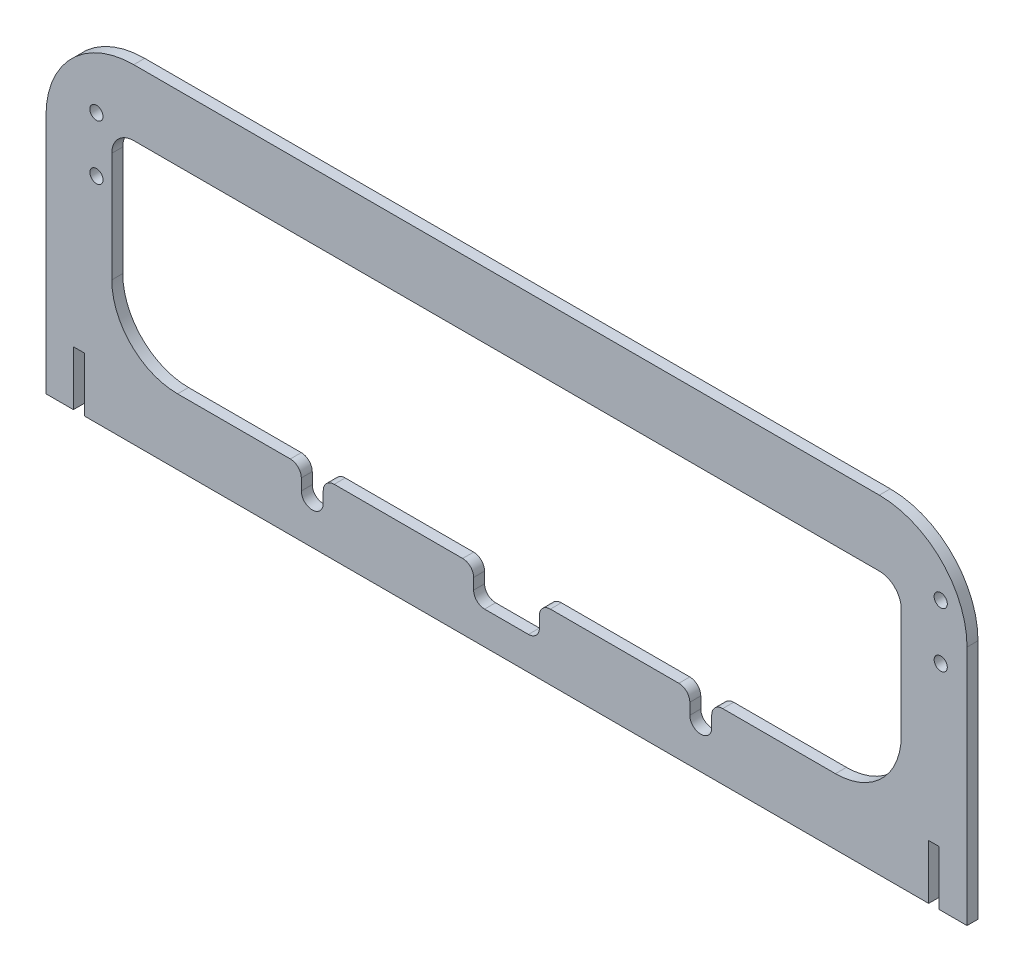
ISO-10303-21;
HEADER;
FILE_DESCRIPTION(('STEP AP214'),'2;1');
FILE_NAME('part.step','',(''),(''),'','','');
FILE_SCHEMA(('AUTOMOTIVE_DESIGN { 1 0 10303 214 1 1 1 1 }'));
ENDSEC;
DATA;
#1=APPLICATION_CONTEXT('core data for automotive mechanical design processes');
#2=APPLICATION_PROTOCOL_DEFINITION('international standard','automotive_design',2000,#1);
#3=PRODUCT_CONTEXT('',#1,'mechanical');
#4=PRODUCT('Part','Part','',(#3));
#5=PRODUCT_RELATED_PRODUCT_CATEGORY('part','',(#4));
#6=PRODUCT_DEFINITION_FORMATION('','',#4);
#7=PRODUCT_DEFINITION_CONTEXT('part definition',#1,'design');
#8=PRODUCT_DEFINITION('design','',#6,#7);
#9=PRODUCT_DEFINITION_SHAPE('','',#8);
#10=(LENGTH_UNIT() NAMED_UNIT(*) SI_UNIT(.MILLI.,.METRE.));
#11=(NAMED_UNIT(*) PLANE_ANGLE_UNIT() SI_UNIT($,.RADIAN.));
#12=(NAMED_UNIT(*) SI_UNIT($,.STERADIAN.) SOLID_ANGLE_UNIT());
#13=UNCERTAINTY_MEASURE_WITH_UNIT(LENGTH_MEASURE(1.E-05),#10,'distance_accuracy_value','');
#14=(GEOMETRIC_REPRESENTATION_CONTEXT(3) GLOBAL_UNCERTAINTY_ASSIGNED_CONTEXT((#13)) GLOBAL_UNIT_ASSIGNED_CONTEXT((#10,
#11,#12)) REPRESENTATION_CONTEXT('',''));
#15=CARTESIAN_POINT('',(0.,0.,0.));
#16=DIRECTION('',(0.,0.,1.));
#17=DIRECTION('',(1.,0.,0.));
#18=AXIS2_PLACEMENT_3D('',#15,#16,#17);
#19=CARTESIAN_POINT('',(210.,0.,2.5));
#20=DIRECTION('',(0.,1.,0.));
#21=DIRECTION('',(0.,0.,1.));
#22=AXIS2_PLACEMENT_3D('',#19,#20,#21);
#23=PLANE('',#22);
#24=DIRECTION('',(1.,0.,0.));
#25=VECTOR('',#24,1.);
#26=CARTESIAN_POINT('',(210.,0.,-2.5));
#27=LINE('',#26,#25);
#28=CARTESIAN_POINT('',(-210.,0.,-2.5));
#29=VERTEX_POINT('',#28);
#30=CARTESIAN_POINT('',(-197.5,0.,-2.5));
#31=VERTEX_POINT('',#30);
#32=EDGE_CURVE('E319',#29,#31,#27,.T.);
#33=ORIENTED_EDGE('',*,*,#32,.T.);
#34=DIRECTION('',(0.,0.,1.));
#35=VECTOR('',#34,1.);
#36=CARTESIAN_POINT('',(-197.5,0.,-2.5));
#37=LINE('',#36,#35);
#38=CARTESIAN_POINT('',(-197.5,0.,2.5));
#39=VERTEX_POINT('',#38);
#40=EDGE_CURVE('E302',#31,#39,#37,.T.);
#41=ORIENTED_EDGE('',*,*,#40,.T.);
#42=DIRECTION('',(1.,0.,0.));
#43=VECTOR('',#42,1.);
#44=CARTESIAN_POINT('',(210.,0.,2.5));
#45=LINE('',#44,#43);
#46=CARTESIAN_POINT('',(-210.,0.,2.5));
#47=VERTEX_POINT('',#46);
#48=EDGE_CURVE('E357',#47,#39,#45,.T.);
#49=ORIENTED_EDGE('',*,*,#48,.F.);
#50=DIRECTION('',(0.,0.,-1.));
#51=VECTOR('',#50,1.);
#52=CARTESIAN_POINT('',(-210.,0.,2.5));
#53=LINE('',#52,#51);
#54=EDGE_CURVE('E325',#47,#29,#53,.T.);
#55=ORIENTED_EDGE('',*,*,#54,.T.);
#56=EDGE_LOOP('',(#33,#41,#49,#55));
#57=FACE_BOUND('',#56,.T.);
#58=ADVANCED_FACE('F34',(#57),#23,.F.);
#59=CARTESIAN_POINT('',(197.286150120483,0.,2.5));
#60=VERTEX_POINT('',#59);
#61=CARTESIAN_POINT('',(210.,0.,2.5));
#62=VERTEX_POINT('',#61);
#63=EDGE_CURVE('E360',#60,#62,#45,.T.);
#64=ORIENTED_EDGE('',*,*,#63,.F.);
#65=DIRECTION('',(0.,0.,1.));
#66=VECTOR('',#65,1.);
#67=CARTESIAN_POINT('',(197.286150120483,0.,-2.5));
#68=LINE('',#67,#66);
#69=CARTESIAN_POINT('',(197.286150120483,0.,-2.5));
#70=VERTEX_POINT('',#69);
#71=EDGE_CURVE('E484',#70,#60,#68,.T.);
#72=ORIENTED_EDGE('',*,*,#71,.F.);
#73=CARTESIAN_POINT('',(210.,0.,-2.5));
#74=VERTEX_POINT('',#73);
#75=EDGE_CURVE('E330',#70,#74,#27,.T.);
#76=ORIENTED_EDGE('',*,*,#75,.T.);
#77=DIRECTION('',(0.,0.,-1.));
#78=VECTOR('',#77,1.);
#79=CARTESIAN_POINT('',(210.,0.,2.5));
#80=LINE('',#79,#78);
#81=EDGE_CURVE('E597',#62,#74,#80,.T.);
#82=ORIENTED_EDGE('',*,*,#81,.F.);
#83=EDGE_LOOP('',(#64,#72,#76,#82));
#84=FACE_BOUND('',#83,.T.);
#85=ADVANCED_FACE('F569',(#84),#23,.F.);
#86=CARTESIAN_POINT('',(-150.,30.,2.5));
#87=DIRECTION('',(0.,1.,0.));
#88=DIRECTION('',(0.,0.,1.));
#89=AXIS2_PLACEMENT_3D('',#86,#87,#88);
#90=PLANE('',#89);
#91=DIRECTION('',(1.,0.,0.));
#92=VECTOR('',#91,1.);
#93=CARTESIAN_POINT('',(-150.,30.,-2.5));
#94=LINE('',#93,#92);
#95=CARTESIAN_POINT('',(-78.580212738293,30.,-2.5));
#96=VERTEX_POINT('',#95);
#97=CARTESIAN_POINT('',(-20.,30.,-2.5));
#98=VERTEX_POINT('',#97);
#99=EDGE_CURVE('E397',#96,#98,#94,.T.);
#100=ORIENTED_EDGE('',*,*,#99,.F.);
#101=DIRECTION('',(0.,0.,1.));
#102=VECTOR('',#101,1.);
#103=CARTESIAN_POINT('',(-78.580212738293,30.,2.5));
#104=LINE('',#103,#102);
#105=CARTESIAN_POINT('',(-78.580212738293,30.,2.5));
#106=VERTEX_POINT('',#105);
#107=EDGE_CURVE('E653',#96,#106,#104,.T.);
#108=ORIENTED_EDGE('',*,*,#107,.T.);
#109=DIRECTION('',(1.,0.,0.));
#110=VECTOR('',#109,1.);
#111=CARTESIAN_POINT('',(-150.,30.,2.5));
#112=LINE('',#111,#110);
#113=CARTESIAN_POINT('',(-20.,30.,2.5));
#114=VERTEX_POINT('',#113);
#115=EDGE_CURVE('E420',#106,#114,#112,.T.);
#116=ORIENTED_EDGE('',*,*,#115,.T.);
#117=DIRECTION('',(0.,0.,1.));
#118=VECTOR('',#117,1.);
#119=CARTESIAN_POINT('',(-20.,30.,-2.5));
#120=LINE('',#119,#118);
#121=EDGE_CURVE('E651',#114,#98,#120,.F.);
#122=ORIENTED_EDGE('',*,*,#121,.T.);
#123=EDGE_LOOP('',(#100,#108,#116,#122));
#124=FACE_BOUND('',#123,.T.);
#125=ADVANCED_FACE('F575',(#124),#90,.T.);
#126=CARTESIAN_POINT('',(-150.,29.9999999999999,2.5));
#127=VERTEX_POINT('',#126);
#128=CARTESIAN_POINT('',(-98.5802127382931,30.,2.5));
#129=VERTEX_POINT('',#128);
#130=EDGE_CURVE('E417',#127,#129,#112,.T.);
#131=ORIENTED_EDGE('',*,*,#130,.T.);
#132=DIRECTION('',(0.,0.,-1.));
#133=VECTOR('',#132,1.);
#134=CARTESIAN_POINT('',(-98.5802127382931,30.,2.5));
#135=LINE('',#134,#133);
#136=CARTESIAN_POINT('',(-98.5802127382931,30.,-2.5));
#137=VERTEX_POINT('',#136);
#138=EDGE_CURVE('E682',#129,#137,#135,.T.);
#139=ORIENTED_EDGE('',*,*,#138,.T.);
#140=CARTESIAN_POINT('',(-150.,29.9999999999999,-2.5));
#141=VERTEX_POINT('',#140);
#142=EDGE_CURVE('E394',#141,#137,#94,.T.);
#143=ORIENTED_EDGE('',*,*,#142,.F.);
#144=DIRECTION('',(0.,0.,-1.));
#145=VECTOR('',#144,1.);
#146=CARTESIAN_POINT('',(-150.,29.9999999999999,2.5));
#147=LINE('',#146,#145);
#148=EDGE_CURVE('E366',#127,#141,#147,.T.);
#149=ORIENTED_EDGE('',*,*,#148,.F.);
#150=EDGE_LOOP('',(#131,#139,#143,#149));
#151=FACE_BOUND('',#150,.T.);
#152=ADVANCED_FACE('F792',(#151),#90,.T.);
#153=CARTESIAN_POINT('',(20.,30.,-2.5));
#154=VERTEX_POINT('',#153);
#155=CARTESIAN_POINT('',(78.580212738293,30.,-2.5));
#156=VERTEX_POINT('',#155);
#157=EDGE_CURVE('E741',#154,#156,#94,.T.);
#158=ORIENTED_EDGE('',*,*,#157,.F.);
#159=DIRECTION('',(0.,0.,-1.));
#160=VECTOR('',#159,1.);
#161=CARTESIAN_POINT('',(20.,30.,2.5));
#162=LINE('',#161,#160);
#163=CARTESIAN_POINT('',(20.,30.,2.5));
#164=VERTEX_POINT('',#163);
#165=EDGE_CURVE('E705',#154,#164,#162,.F.);
#166=ORIENTED_EDGE('',*,*,#165,.T.);
#167=CARTESIAN_POINT('',(78.580212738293,30.,2.5));
#168=VERTEX_POINT('',#167);
#169=EDGE_CURVE('E421',#164,#168,#112,.T.);
#170=ORIENTED_EDGE('',*,*,#169,.T.);
#171=DIRECTION('',(0.,0.,1.));
#172=VECTOR('',#171,1.);
#173=CARTESIAN_POINT('',(78.580212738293,30.,-2.5));
#174=LINE('',#173,#172);
#175=EDGE_CURVE('E703',#168,#156,#174,.F.);
#176=ORIENTED_EDGE('',*,*,#175,.T.);
#177=EDGE_LOOP('',(#158,#166,#170,#176));
#178=FACE_BOUND('',#177,.T.);
#179=ADVANCED_FACE('F744',(#178),#90,.T.);
#180=CARTESIAN_POINT('',(-170.,110.,2.5));
#181=DIRECTION('',(0.,0.,-1.));
#182=DIRECTION('',(-1.,0.,0.));
#183=AXIS2_PLACEMENT_3D('',#180,#181,#182);
#184=PLANE('',#183);
#185=CARTESIAN_POINT('',(198.000000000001,97.5000000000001,2.5));
#186=DIRECTION('',(0.,0.,-1.));
#187=DIRECTION('',(-1.,0.,0.));
#188=AXIS2_PLACEMENT_3D('',#185,#186,#187);
#189=CIRCLE('',#188,2.99999999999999);
#190=CARTESIAN_POINT('',(195.000000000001,97.5000000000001,2.5));
#191=VERTEX_POINT('',#190);
#192=EDGE_CURVE('E523',#191,#191,#189,.T.);
#193=ORIENTED_EDGE('',*,*,#192,.T.);
#194=EDGE_LOOP('',(#193));
#195=FACE_BOUND('',#194,.T.);
#196=CARTESIAN_POINT('',(198.000000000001,122.5,2.5));
#197=DIRECTION('',(0.,0.,-1.));
#198=DIRECTION('',(-1.,0.,0.));
#199=AXIS2_PLACEMENT_3D('',#196,#197,#198);
#200=CIRCLE('',#199,2.99999999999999);
#201=CARTESIAN_POINT('',(195.000000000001,122.5,2.5));
#202=VERTEX_POINT('',#201);
#203=EDGE_CURVE('E529',#202,#202,#200,.T.);
#204=ORIENTED_EDGE('',*,*,#203,.T.);
#205=EDGE_LOOP('',(#204));
#206=FACE_BOUND('',#205,.T.);
#207=CARTESIAN_POINT('',(-187.,122.5,2.5));
#208=DIRECTION('',(0.,0.,-1.));
#209=DIRECTION('',(-1.,0.,0.));
#210=AXIS2_PLACEMENT_3D('',#207,#208,#209);
#211=CIRCLE('',#210,2.99999999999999);
#212=CARTESIAN_POINT('',(-190.,122.5,2.5));
#213=VERTEX_POINT('',#212);
#214=EDGE_CURVE('E517',#213,#213,#211,.T.);
#215=ORIENTED_EDGE('',*,*,#214,.T.);
#216=EDGE_LOOP('',(#215));
#217=FACE_BOUND('',#216,.T.);
#218=CARTESIAN_POINT('',(-187.,97.5,2.5));
#219=DIRECTION('',(0.,0.,-1.));
#220=DIRECTION('',(-1.,0.,0.));
#221=AXIS2_PLACEMENT_3D('',#218,#219,#220);
#222=CIRCLE('',#221,2.99999999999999);
#223=CARTESIAN_POINT('',(-190.,97.5,2.5));
#224=VERTEX_POINT('',#223);
#225=EDGE_CURVE('E494',#224,#224,#222,.T.);
#226=ORIENTED_EDGE('',*,*,#225,.T.);
#227=EDGE_LOOP('',(#226));
#228=FACE_BOUND('',#227,.T.);
#229=ORIENTED_EDGE('',*,*,#115,.F.);
#230=CARTESIAN_POINT('',(-78.580212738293,25.,2.5));
#231=DIRECTION('',(0.,0.,-1.));
#232=DIRECTION('',(-1.,0.,0.));
#233=AXIS2_PLACEMENT_3D('',#230,#231,#232);
#234=CIRCLE('',#233,5.);
#235=CARTESIAN_POINT('',(-83.5802127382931,25.,2.5));
#236=VERTEX_POINT('',#235);
#237=EDGE_CURVE('E666',#106,#236,#234,.F.);
#238=ORIENTED_EDGE('',*,*,#237,.T.);
#239=DIRECTION('',(0.,1.,0.));
#240=VECTOR('',#239,1.);
#241=CARTESIAN_POINT('',(-83.5802127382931,110.,2.5));
#242=LINE('',#241,#240);
#243=CARTESIAN_POINT('',(-83.5802127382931,19.8636187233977,2.5));
#244=VERTEX_POINT('',#243);
#245=EDGE_CURVE('E457',#244,#236,#242,.T.);
#246=ORIENTED_EDGE('',*,*,#245,.F.);
#247=CARTESIAN_POINT('',(-88.5802127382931,19.8636187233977,2.5));
#248=DIRECTION('',(0.,0.,-1.));
#249=DIRECTION('',(-1.,0.,0.));
#250=AXIS2_PLACEMENT_3D('',#247,#248,#249);
#251=CIRCLE('',#250,5.);
#252=CARTESIAN_POINT('',(-93.5802127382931,19.8636187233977,2.5));
#253=VERTEX_POINT('',#252);
#254=EDGE_CURVE('E462',#253,#244,#251,.F.);
#255=ORIENTED_EDGE('',*,*,#254,.F.);
#256=DIRECTION('',(0.,-1.,0.));
#257=VECTOR('',#256,1.);
#258=CARTESIAN_POINT('',(-93.5802127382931,110.,2.5));
#259=LINE('',#258,#257);
#260=CARTESIAN_POINT('',(-93.5802127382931,25.,2.5));
#261=VERTEX_POINT('',#260);
#262=EDGE_CURVE('E460',#261,#253,#259,.T.);
#263=ORIENTED_EDGE('',*,*,#262,.F.);
#264=CARTESIAN_POINT('',(-98.5802127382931,25.,2.5));
#265=DIRECTION('',(0.,0.,-1.));
#266=DIRECTION('',(-1.,0.,0.));
#267=AXIS2_PLACEMENT_3D('',#264,#265,#266);
#268=CIRCLE('',#267,5.);
#269=EDGE_CURVE('E664',#261,#129,#268,.F.);
#270=ORIENTED_EDGE('',*,*,#269,.T.);
#271=ORIENTED_EDGE('',*,*,#130,.F.);
#272=CARTESIAN_POINT('',(-150.,60.,2.5));
#273=DIRECTION('',(0.,0.,1.));
#274=DIRECTION('',(-1.,0.,0.));
#275=AXIS2_PLACEMENT_3D('',#272,#273,#274);
#276=CIRCLE('',#275,30.);
#277=CARTESIAN_POINT('',(-180.,60.,2.5));
#278=VERTEX_POINT('',#277);
#279=EDGE_CURVE('E422',#278,#127,#276,.T.);
#280=ORIENTED_EDGE('',*,*,#279,.F.);
#281=DIRECTION('',(0.,-1.,0.));
#282=VECTOR('',#281,1.);
#283=CARTESIAN_POINT('',(-180.,60.,2.5));
#284=LINE('',#283,#282);
#285=CARTESIAN_POINT('',(-180.,110.,2.5));
#286=VERTEX_POINT('',#285);
#287=EDGE_CURVE('E425',#286,#278,#284,.T.);
#288=ORIENTED_EDGE('',*,*,#287,.F.);
#289=CARTESIAN_POINT('',(-170.,110.,2.5));
#290=DIRECTION('',(0.,0.,1.));
#291=DIRECTION('',(-1.,0.,0.));
#292=AXIS2_PLACEMENT_3D('',#289,#290,#291);
#293=CIRCLE('',#292,10.);
#294=CARTESIAN_POINT('',(-170.,120.,2.5));
#295=VERTEX_POINT('',#294);
#296=EDGE_CURVE('E384',#295,#286,#293,.T.);
#297=ORIENTED_EDGE('',*,*,#296,.F.);
#298=DIRECTION('',(-1.,0.,0.));
#299=VECTOR('',#298,1.);
#300=CARTESIAN_POINT('',(-170.,120.,2.5));
#301=LINE('',#300,#299);
#302=CARTESIAN_POINT('',(170.,120.,2.5));
#303=VERTEX_POINT('',#302);
#304=EDGE_CURVE('E380',#303,#295,#301,.T.);
#305=ORIENTED_EDGE('',*,*,#304,.F.);
#306=CARTESIAN_POINT('',(170.,110.,2.5));
#307=DIRECTION('',(0.,0.,1.));
#308=DIRECTION('',(-1.,0.,0.));
#309=AXIS2_PLACEMENT_3D('',#306,#307,#308);
#310=CIRCLE('',#309,10.);
#311=CARTESIAN_POINT('',(180.,110.,2.5));
#312=VERTEX_POINT('',#311);
#313=EDGE_CURVE('E410',#312,#303,#310,.T.);
#314=ORIENTED_EDGE('',*,*,#313,.F.);
#315=DIRECTION('',(0.,1.,0.));
#316=VECTOR('',#315,1.);
#317=CARTESIAN_POINT('',(180.,110.,2.5));
#318=LINE('',#317,#316);
#319=CARTESIAN_POINT('',(180.,60.,2.5));
#320=VERTEX_POINT('',#319);
#321=EDGE_CURVE('E413',#320,#312,#318,.T.);
#322=ORIENTED_EDGE('',*,*,#321,.F.);
#323=CARTESIAN_POINT('',(150.,60.,2.5));
#324=DIRECTION('',(0.,0.,1.));
#325=DIRECTION('',(1.,0.,0.));
#326=AXIS2_PLACEMENT_3D('',#323,#324,#325);
#327=CIRCLE('',#326,30.);
#328=CARTESIAN_POINT('',(150.,30.,2.5));
#329=VERTEX_POINT('',#328);
#330=EDGE_CURVE('E415',#329,#320,#327,.T.);
#331=ORIENTED_EDGE('',*,*,#330,.F.);
#332=CARTESIAN_POINT('',(98.5802127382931,30.,2.5));
#333=VERTEX_POINT('',#332);
#334=EDGE_CURVE('E424',#333,#329,#112,.T.);
#335=ORIENTED_EDGE('',*,*,#334,.F.);
#336=CARTESIAN_POINT('',(98.5802127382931,25.,2.5));
#337=DIRECTION('',(0.,0.,-1.));
#338=DIRECTION('',(-1.,0.,0.));
#339=AXIS2_PLACEMENT_3D('',#336,#337,#338);
#340=CIRCLE('',#339,5.);
#341=CARTESIAN_POINT('',(93.580212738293,25.,2.5));
#342=VERTEX_POINT('',#341);
#343=EDGE_CURVE('E658',#333,#342,#340,.F.);
#344=ORIENTED_EDGE('',*,*,#343,.T.);
#345=DIRECTION('',(0.,-1.,0.));
#346=VECTOR('',#345,1.);
#347=CARTESIAN_POINT('',(93.580212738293,110.,2.5));
#348=LINE('',#347,#346);
#349=CARTESIAN_POINT('',(93.5802127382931,19.8636187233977,2.5));
#350=VERTEX_POINT('',#349);
#351=EDGE_CURVE('E433',#342,#350,#348,.T.);
#352=ORIENTED_EDGE('',*,*,#351,.T.);
#353=CARTESIAN_POINT('',(88.5802127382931,19.8636187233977,2.5));
#354=DIRECTION('',(0.,0.,-1.));
#355=DIRECTION('',(-1.,0.,0.));
#356=AXIS2_PLACEMENT_3D('',#353,#354,#355);
#357=CIRCLE('',#356,5.);
#358=CARTESIAN_POINT('',(83.5802127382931,19.8636187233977,2.5));
#359=VERTEX_POINT('',#358);
#360=EDGE_CURVE('E408',#350,#359,#357,.T.);
#361=ORIENTED_EDGE('',*,*,#360,.T.);
#362=DIRECTION('',(0.,1.,0.));
#363=VECTOR('',#362,1.);
#364=CARTESIAN_POINT('',(83.580212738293,110.,2.5));
#365=LINE('',#364,#363);
#366=CARTESIAN_POINT('',(83.580212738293,25.,2.5));
#367=VERTEX_POINT('',#366);
#368=EDGE_CURVE('E430',#359,#367,#365,.T.);
#369=ORIENTED_EDGE('',*,*,#368,.T.);
#370=CARTESIAN_POINT('',(78.580212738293,25.,2.5));
#371=DIRECTION('',(0.,0.,-1.));
#372=DIRECTION('',(-1.,0.,0.));
#373=AXIS2_PLACEMENT_3D('',#370,#371,#372);
#374=CIRCLE('',#373,5.);
#375=EDGE_CURVE('E656',#367,#168,#374,.F.);
#376=ORIENTED_EDGE('',*,*,#375,.T.);
#377=ORIENTED_EDGE('',*,*,#169,.F.);
#378=CARTESIAN_POINT('',(20.,25.,2.5));
#379=DIRECTION('',(0.,0.,-1.));
#380=DIRECTION('',(-1.,0.,0.));
#381=AXIS2_PLACEMENT_3D('',#378,#379,#380);
#382=CIRCLE('',#381,5.);
#383=CARTESIAN_POINT('',(15.,25.,2.5));
#384=VERTEX_POINT('',#383);
#385=EDGE_CURVE('E660',#164,#384,#382,.F.);
#386=ORIENTED_EDGE('',*,*,#385,.T.);
#387=DIRECTION('',(0.,1.,0.));
#388=VECTOR('',#387,1.);
#389=CARTESIAN_POINT('',(15.,45.,2.5));
#390=LINE('',#389,#388);
#391=CARTESIAN_POINT('',(15.,19.9999999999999,2.5));
#392=VERTEX_POINT('',#391);
#393=EDGE_CURVE('E448',#392,#384,#390,.T.);
#394=ORIENTED_EDGE('',*,*,#393,.F.);
#395=CARTESIAN_POINT('',(9.99999999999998,19.9999999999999,2.5));
#396=DIRECTION('',(0.,0.,-1.));
#397=DIRECTION('',(-1.,0.,0.));
#398=AXIS2_PLACEMENT_3D('',#395,#396,#397);
#399=CIRCLE('',#398,5.);
#400=CARTESIAN_POINT('',(9.99999999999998,14.9999999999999,2.5));
#401=VERTEX_POINT('',#400);
#402=EDGE_CURVE('E42',#392,#401,#399,.T.);
#403=ORIENTED_EDGE('',*,*,#402,.T.);
#404=DIRECTION('',(1.,0.,0.));
#405=VECTOR('',#404,1.);
#406=CARTESIAN_POINT('',(15.,14.9999999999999,2.5));
#407=LINE('',#406,#405);
#408=CARTESIAN_POINT('',(-10.,14.9999999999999,2.5));
#409=VERTEX_POINT('',#408);
#410=EDGE_CURVE('E451',#409,#401,#407,.T.);
#411=ORIENTED_EDGE('',*,*,#410,.F.);
#412=CARTESIAN_POINT('',(-10.,19.9999999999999,2.5));
#413=DIRECTION('',(0.,0.,-1.));
#414=DIRECTION('',(-1.,0.,0.));
#415=AXIS2_PLACEMENT_3D('',#412,#413,#414);
#416=CIRCLE('',#415,5.);
#417=CARTESIAN_POINT('',(-15.,19.9999999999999,2.5));
#418=VERTEX_POINT('',#417);
#419=EDGE_CURVE('E715',#409,#418,#416,.T.);
#420=ORIENTED_EDGE('',*,*,#419,.T.);
#421=DIRECTION('',(0.,-1.,0.));
#422=VECTOR('',#421,1.);
#423=CARTESIAN_POINT('',(-15.,45.,2.5));
#424=LINE('',#423,#422);
#425=CARTESIAN_POINT('',(-15.,25.,2.5));
#426=VERTEX_POINT('',#425);
#427=EDGE_CURVE('E454',#426,#418,#424,.T.);
#428=ORIENTED_EDGE('',*,*,#427,.F.);
#429=CARTESIAN_POINT('',(-20.,25.,2.5));
#430=DIRECTION('',(0.,0.,-1.));
#431=DIRECTION('',(-1.,0.,0.));
#432=AXIS2_PLACEMENT_3D('',#429,#430,#431);
#433=CIRCLE('',#432,5.);
#434=EDGE_CURVE('E662',#426,#114,#433,.F.);
#435=ORIENTED_EDGE('',*,*,#434,.T.);
#436=EDGE_LOOP('',(#229,#238,#246,#255,#263,#270,#271,#280,#288,#297,#305,#314,#322,#331,#335,
#344,#352,#361,#369,#376,#377,#386,#394,#403,#411,#420,#428,#435));
#437=FACE_BOUND('',#436,.T.);
#438=ORIENTED_EDGE('',*,*,#48,.T.);
#439=DIRECTION('',(0.,-1.,0.));
#440=VECTOR('',#439,1.);
#441=CARTESIAN_POINT('',(-197.5,0.,2.5));
#442=LINE('',#441,#440);
#443=CARTESIAN_POINT('',(-197.5,24.8636187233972,2.5));
#444=VERTEX_POINT('',#443);
#445=EDGE_CURVE('E308',#444,#39,#442,.T.);
#446=ORIENTED_EDGE('',*,*,#445,.F.);
#447=DIRECTION('',(-1.,0.,0.));
#448=VECTOR('',#447,1.);
#449=CARTESIAN_POINT('',(-197.5,24.8636187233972,2.5));
#450=LINE('',#449,#448);
#451=CARTESIAN_POINT('',(-192.5,24.8636187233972,2.5));
#452=VERTEX_POINT('',#451);
#453=EDGE_CURVE('E322',#452,#444,#450,.T.);
#454=ORIENTED_EDGE('',*,*,#453,.F.);
#455=DIRECTION('',(0.,1.,0.));
#456=VECTOR('',#455,1.);
#457=CARTESIAN_POINT('',(-192.5,0.,2.5));
#458=LINE('',#457,#456);
#459=CARTESIAN_POINT('',(-192.5,0.,2.5));
#460=VERTEX_POINT('',#459);
#461=EDGE_CURVE('E508',#460,#452,#458,.T.);
#462=ORIENTED_EDGE('',*,*,#461,.F.);
#463=CARTESIAN_POINT('',(192.5,0.,2.5));
#464=VERTEX_POINT('',#463);
#465=EDGE_CURVE('E359',#460,#464,#45,.T.);
#466=ORIENTED_EDGE('',*,*,#465,.T.);
#467=DIRECTION('',(0.,-1.,0.));
#468=VECTOR('',#467,1.);
#469=CARTESIAN_POINT('',(192.5,0.,2.5));
#470=LINE('',#469,#468);
#471=CARTESIAN_POINT('',(192.5,24.8636187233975,2.5));
#472=VERTEX_POINT('',#471);
#473=EDGE_CURVE('E49',#472,#464,#470,.T.);
#474=ORIENTED_EDGE('',*,*,#473,.F.);
#475=DIRECTION('',(-1.,0.,0.));
#476=VECTOR('',#475,1.);
#477=CARTESIAN_POINT('',(197.286150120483,24.8636187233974,2.5));
#478=LINE('',#477,#476);
#479=CARTESIAN_POINT('',(197.286150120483,24.8636187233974,2.5));
#480=VERTEX_POINT('',#479);
#481=EDGE_CURVE('E488',#480,#472,#478,.T.);
#482=ORIENTED_EDGE('',*,*,#481,.F.);
#483=DIRECTION('',(0.,1.,0.));
#484=VECTOR('',#483,1.);
#485=CARTESIAN_POINT('',(197.286150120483,0.,2.5));
#486=LINE('',#485,#484);
#487=EDGE_CURVE('E491',#60,#480,#486,.T.);
#488=ORIENTED_EDGE('',*,*,#487,.F.);
#489=ORIENTED_EDGE('',*,*,#63,.T.);
#490=DIRECTION('',(0.,1.,0.));
#491=VECTOR('',#490,1.);
#492=CARTESIAN_POINT('',(210.,110.,2.5));
#493=LINE('',#492,#491);
#494=CARTESIAN_POINT('',(210.,110.,2.5));
#495=VERTEX_POINT('',#494);
#496=EDGE_CURVE('E355',#62,#495,#493,.T.);
#497=ORIENTED_EDGE('',*,*,#496,.T.);
#498=CARTESIAN_POINT('',(170.,110.,2.5));
#499=DIRECTION('',(0.,0.,1.));
#500=DIRECTION('',(-1.,0.,0.));
#501=AXIS2_PLACEMENT_3D('',#498,#499,#500);
#502=CIRCLE('',#501,40.);
#503=CARTESIAN_POINT('',(170.,150.,2.5));
#504=VERTEX_POINT('',#503);
#505=EDGE_CURVE('E353',#495,#504,#502,.T.);
#506=ORIENTED_EDGE('',*,*,#505,.T.);
#507=DIRECTION('',(-1.,0.,0.));
#508=VECTOR('',#507,1.);
#509=CARTESIAN_POINT('',(-170.,150.,2.5));
#510=LINE('',#509,#508);
#511=CARTESIAN_POINT('',(-170.,150.,2.5));
#512=VERTEX_POINT('',#511);
#513=EDGE_CURVE('E351',#504,#512,#510,.T.);
#514=ORIENTED_EDGE('',*,*,#513,.T.);
#515=CARTESIAN_POINT('',(-170.,110.,2.5));
#516=DIRECTION('',(0.,0.,1.));
#517=DIRECTION('',(-1.,0.,0.));
#518=AXIS2_PLACEMENT_3D('',#515,#516,#517);
#519=CIRCLE('',#518,40.);
#520=CARTESIAN_POINT('',(-210.,110.,2.5));
#521=VERTEX_POINT('',#520);
#522=EDGE_CURVE('E348',#512,#521,#519,.T.);
#523=ORIENTED_EDGE('',*,*,#522,.T.);
#524=DIRECTION('',(0.,-1.,0.));
#525=VECTOR('',#524,1.);
#526=CARTESIAN_POINT('',(-210.,0.,2.5));
#527=LINE('',#526,#525);
#528=EDGE_CURVE('E361',#521,#47,#527,.T.);
#529=ORIENTED_EDGE('',*,*,#528,.T.);
#530=EDGE_LOOP('',(#438,#446,#454,#462,#466,#474,#482,#488,#489,#497,#506,#514,#523,#529));
#531=FACE_BOUND('',#530,.T.);
#532=ADVANCED_FACE('F538',(#195,#206,#217,#228,#437,#531),#184,.F.);
#533=CARTESIAN_POINT('',(-170.,110.,-2.5));
#534=DIRECTION('',(0.,0.,-1.));
#535=DIRECTION('',(-1.,0.,0.));
#536=AXIS2_PLACEMENT_3D('',#533,#534,#535);
#537=PLANE('',#536);
#538=CARTESIAN_POINT('',(198.000000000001,97.5000000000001,-2.5));
#539=DIRECTION('',(0.,0.,-1.));
#540=DIRECTION('',(-1.,0.,0.));
#541=AXIS2_PLACEMENT_3D('',#538,#539,#540);
#542=CIRCLE('',#541,2.99999999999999);
#543=CARTESIAN_POINT('',(195.000000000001,97.5000000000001,-2.5));
#544=VERTEX_POINT('',#543);
#545=EDGE_CURVE('E520',#544,#544,#542,.T.);
#546=ORIENTED_EDGE('',*,*,#545,.F.);
#547=EDGE_LOOP('',(#546));
#548=FACE_BOUND('',#547,.T.);
#549=CARTESIAN_POINT('',(198.000000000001,122.5,-2.5));
#550=DIRECTION('',(0.,0.,-1.));
#551=DIRECTION('',(-1.,0.,0.));
#552=AXIS2_PLACEMENT_3D('',#549,#550,#551);
#553=CIRCLE('',#552,2.99999999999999);
#554=CARTESIAN_POINT('',(195.000000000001,122.5,-2.5));
#555=VERTEX_POINT('',#554);
#556=EDGE_CURVE('E526',#555,#555,#553,.T.);
#557=ORIENTED_EDGE('',*,*,#556,.F.);
#558=EDGE_LOOP('',(#557));
#559=FACE_BOUND('',#558,.T.);
#560=CARTESIAN_POINT('',(-187.,122.5,-2.5));
#561=DIRECTION('',(0.,0.,-1.));
#562=DIRECTION('',(-1.,0.,0.));
#563=AXIS2_PLACEMENT_3D('',#560,#561,#562);
#564=CIRCLE('',#563,2.99999999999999);
#565=CARTESIAN_POINT('',(-190.,122.5,-2.5));
#566=VERTEX_POINT('',#565);
#567=EDGE_CURVE('E532',#566,#566,#564,.T.);
#568=ORIENTED_EDGE('',*,*,#567,.F.);
#569=EDGE_LOOP('',(#568));
#570=FACE_BOUND('',#569,.T.);
#571=CARTESIAN_POINT('',(-187.,97.5,-2.5));
#572=DIRECTION('',(0.,0.,-1.));
#573=DIRECTION('',(-1.,0.,0.));
#574=AXIS2_PLACEMENT_3D('',#571,#572,#573);
#575=CIRCLE('',#574,2.99999999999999);
#576=CARTESIAN_POINT('',(-190.,97.5,-2.5));
#577=VERTEX_POINT('',#576);
#578=EDGE_CURVE('E514',#577,#577,#575,.T.);
#579=ORIENTED_EDGE('',*,*,#578,.F.);
#580=EDGE_LOOP('',(#579));
#581=FACE_BOUND('',#580,.T.);
#582=DIRECTION('',(0.,-1.,0.));
#583=VECTOR('',#582,1.);
#584=CARTESIAN_POINT('',(-197.5,0.,-2.5));
#585=LINE('',#584,#583);
#586=CARTESIAN_POINT('',(-197.5,24.8636187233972,-2.5));
#587=VERTEX_POINT('',#586);
#588=EDGE_CURVE('E305',#587,#31,#585,.T.);
#589=ORIENTED_EDGE('',*,*,#588,.T.);
#590=ORIENTED_EDGE('',*,*,#32,.F.);
#591=DIRECTION('',(0.,-1.,0.));
#592=VECTOR('',#591,1.);
#593=CARTESIAN_POINT('',(-210.,0.,-2.5));
#594=LINE('',#593,#592);
#595=CARTESIAN_POINT('',(-210.,110.,-2.5));
#596=VERTEX_POINT('',#595);
#597=EDGE_CURVE('E335',#596,#29,#594,.T.);
#598=ORIENTED_EDGE('',*,*,#597,.F.);
#599=CARTESIAN_POINT('',(-170.,110.,-2.5));
#600=DIRECTION('',(0.,0.,1.));
#601=DIRECTION('',(-1.,0.,0.));
#602=AXIS2_PLACEMENT_3D('',#599,#600,#601);
#603=CIRCLE('',#602,40.);
#604=CARTESIAN_POINT('',(-170.,150.,-2.5));
#605=VERTEX_POINT('',#604);
#606=EDGE_CURVE('E363',#605,#596,#603,.T.);
#607=ORIENTED_EDGE('',*,*,#606,.F.);
#608=DIRECTION('',(-1.,0.,0.));
#609=VECTOR('',#608,1.);
#610=CARTESIAN_POINT('',(-170.,150.,-2.5));
#611=LINE('',#610,#609);
#612=CARTESIAN_POINT('',(170.,150.,-2.5));
#613=VERTEX_POINT('',#612);
#614=EDGE_CURVE('E618',#613,#605,#611,.T.);
#615=ORIENTED_EDGE('',*,*,#614,.F.);
#616=CARTESIAN_POINT('',(170.,110.,-2.5));
#617=DIRECTION('',(0.,0.,1.));
#618=DIRECTION('',(-1.,0.,0.));
#619=AXIS2_PLACEMENT_3D('',#616,#617,#618);
#620=CIRCLE('',#619,40.);
#621=CARTESIAN_POINT('',(210.,110.,-2.5));
#622=VERTEX_POINT('',#621);
#623=EDGE_CURVE('E331',#622,#613,#620,.T.);
#624=ORIENTED_EDGE('',*,*,#623,.F.);
#625=DIRECTION('',(0.,1.,0.));
#626=VECTOR('',#625,1.);
#627=CARTESIAN_POINT('',(210.,110.,-2.5));
#628=LINE('',#627,#626);
#629=EDGE_CURVE('E327',#74,#622,#628,.T.);
#630=ORIENTED_EDGE('',*,*,#629,.F.);
#631=ORIENTED_EDGE('',*,*,#75,.F.);
#632=DIRECTION('',(0.,1.,0.));
#633=VECTOR('',#632,1.);
#634=CARTESIAN_POINT('',(197.286150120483,0.,-2.5));
#635=LINE('',#634,#633);
#636=CARTESIAN_POINT('',(197.286150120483,24.8636187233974,-2.5));
#637=VERTEX_POINT('',#636);
#638=EDGE_CURVE('E487',#70,#637,#635,.T.);
#639=ORIENTED_EDGE('',*,*,#638,.T.);
#640=DIRECTION('',(-1.,0.,0.));
#641=VECTOR('',#640,1.);
#642=CARTESIAN_POINT('',(197.286150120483,24.8636187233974,-2.5));
#643=LINE('',#642,#641);
#644=CARTESIAN_POINT('',(192.5,24.8636187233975,-2.5));
#645=VERTEX_POINT('',#644);
#646=EDGE_CURVE('E497',#637,#645,#643,.T.);
#647=ORIENTED_EDGE('',*,*,#646,.T.);
#648=DIRECTION('',(0.,-1.,0.));
#649=VECTOR('',#648,1.);
#650=CARTESIAN_POINT('',(192.5,0.,-2.5));
#651=LINE('',#650,#649);
#652=CARTESIAN_POINT('',(192.5,0.,-2.5));
#653=VERTEX_POINT('',#652);
#654=EDGE_CURVE('E480',#645,#653,#651,.T.);
#655=ORIENTED_EDGE('',*,*,#654,.T.);
#656=CARTESIAN_POINT('',(-192.5,0.,-2.5));
#657=VERTEX_POINT('',#656);
#658=EDGE_CURVE('E328',#657,#653,#27,.T.);
#659=ORIENTED_EDGE('',*,*,#658,.F.);
#660=DIRECTION('',(0.,1.,0.));
#661=VECTOR('',#660,1.);
#662=CARTESIAN_POINT('',(-192.5,0.,-2.5));
#663=LINE('',#662,#661);
#664=CARTESIAN_POINT('',(-192.5,24.8636187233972,-2.5));
#665=VERTEX_POINT('',#664);
#666=EDGE_CURVE('E57',#657,#665,#663,.T.);
#667=ORIENTED_EDGE('',*,*,#666,.T.);
#668=DIRECTION('',(-1.,0.,0.));
#669=VECTOR('',#668,1.);
#670=CARTESIAN_POINT('',(-197.5,24.8636187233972,-2.5));
#671=LINE('',#670,#669);
#672=EDGE_CURVE('E313',#665,#587,#671,.T.);
#673=ORIENTED_EDGE('',*,*,#672,.T.);
#674=EDGE_LOOP('',(#589,#590,#598,#607,#615,#624,#630,#631,#639,#647,#655,#659,#667,#673));
#675=FACE_BOUND('',#674,.T.);
#676=DIRECTION('',(0.,1.,0.));
#677=VECTOR('',#676,1.);
#678=CARTESIAN_POINT('',(-83.5802127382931,39.8636187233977,-2.5));
#679=LINE('',#678,#677);
#680=CARTESIAN_POINT('',(-83.5802127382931,19.8636187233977,-2.5));
#681=VERTEX_POINT('',#680);
#682=CARTESIAN_POINT('',(-83.5802127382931,25.,-2.5));
#683=VERTEX_POINT('',#682);
#684=EDGE_CURVE('E473',#681,#683,#679,.T.);
#685=ORIENTED_EDGE('',*,*,#684,.T.);
#686=CARTESIAN_POINT('',(-78.580212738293,25.,-2.5));
#687=DIRECTION('',(0.,0.,-1.));
#688=DIRECTION('',(-1.,0.,0.));
#689=AXIS2_PLACEMENT_3D('',#686,#687,#688);
#690=CIRCLE('',#689,5.);
#691=EDGE_CURVE('E680',#683,#96,#690,.T.);
#692=ORIENTED_EDGE('',*,*,#691,.T.);
#693=ORIENTED_EDGE('',*,*,#99,.T.);
#694=CARTESIAN_POINT('',(-20.,25.,-2.5));
#695=DIRECTION('',(0.,0.,-1.));
#696=DIRECTION('',(-1.,0.,0.));
#697=AXIS2_PLACEMENT_3D('',#694,#695,#696);
#698=CIRCLE('',#697,5.);
#699=CARTESIAN_POINT('',(-15.,25.,-2.5));
#700=VERTEX_POINT('',#699);
#701=EDGE_CURVE('E676',#98,#700,#698,.T.);
#702=ORIENTED_EDGE('',*,*,#701,.T.);
#703=DIRECTION('',(0.,1.,0.));
#704=VECTOR('',#703,1.);
#705=CARTESIAN_POINT('',(-15.,110.,-2.5));
#706=LINE('',#705,#704);
#707=CARTESIAN_POINT('',(-15.,19.9999999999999,-2.5));
#708=VERTEX_POINT('',#707);
#709=EDGE_CURVE('E646',#708,#700,#706,.T.);
#710=ORIENTED_EDGE('',*,*,#709,.F.);
#711=CARTESIAN_POINT('',(-10.,19.9999999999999,-2.5));
#712=DIRECTION('',(0.,0.,-1.));
#713=DIRECTION('',(-1.,0.,0.));
#714=AXIS2_PLACEMENT_3D('',#711,#712,#713);
#715=CIRCLE('',#714,5.);
#716=CARTESIAN_POINT('',(-10.,14.9999999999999,-2.5));
#717=VERTEX_POINT('',#716);
#718=EDGE_CURVE('E717',#708,#717,#715,.F.);
#719=ORIENTED_EDGE('',*,*,#718,.T.);
#720=DIRECTION('',(-1.,0.,0.));
#721=VECTOR('',#720,1.);
#722=CARTESIAN_POINT('',(-170.,14.9999999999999,-2.5));
#723=LINE('',#722,#721);
#724=CARTESIAN_POINT('',(9.99999999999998,14.9999999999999,-2.5));
#725=VERTEX_POINT('',#724);
#726=EDGE_CURVE('E640',#725,#717,#723,.T.);
#727=ORIENTED_EDGE('',*,*,#726,.F.);
#728=CARTESIAN_POINT('',(9.99999999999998,19.9999999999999,-2.5));
#729=DIRECTION('',(0.,0.,-1.));
#730=DIRECTION('',(-1.,0.,0.));
#731=AXIS2_PLACEMENT_3D('',#728,#729,#730);
#732=CIRCLE('',#731,5.);
#733=CARTESIAN_POINT('',(15.,19.9999999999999,-2.5));
#734=VERTEX_POINT('',#733);
#735=EDGE_CURVE('E11',#725,#734,#732,.F.);
#736=ORIENTED_EDGE('',*,*,#735,.T.);
#737=DIRECTION('',(0.,-1.,0.));
#738=VECTOR('',#737,1.);
#739=CARTESIAN_POINT('',(15.,110.,-2.5));
#740=LINE('',#739,#738);
#741=CARTESIAN_POINT('',(15.,25.,-2.5));
#742=VERTEX_POINT('',#741);
#743=EDGE_CURVE('E643',#742,#734,#740,.T.);
#744=ORIENTED_EDGE('',*,*,#743,.F.);
#745=CARTESIAN_POINT('',(20.,25.,-2.5));
#746=DIRECTION('',(0.,0.,-1.));
#747=DIRECTION('',(-1.,0.,0.));
#748=AXIS2_PLACEMENT_3D('',#745,#746,#747);
#749=CIRCLE('',#748,5.);
#750=EDGE_CURVE('E674',#742,#154,#749,.T.);
#751=ORIENTED_EDGE('',*,*,#750,.T.);
#752=ORIENTED_EDGE('',*,*,#157,.T.);
#753=CARTESIAN_POINT('',(78.580212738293,25.,-2.5));
#754=DIRECTION('',(0.,0.,-1.));
#755=DIRECTION('',(-1.,0.,0.));
#756=AXIS2_PLACEMENT_3D('',#753,#754,#755);
#757=CIRCLE('',#756,5.);
#758=CARTESIAN_POINT('',(83.5802127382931,25.,-2.5));
#759=VERTEX_POINT('',#758);
#760=EDGE_CURVE('E670',#156,#759,#757,.T.);
#761=ORIENTED_EDGE('',*,*,#760,.T.);
#762=DIRECTION('',(0.,1.,0.));
#763=VECTOR('',#762,1.);
#764=CARTESIAN_POINT('',(83.5802127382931,39.8636187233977,-2.5));
#765=LINE('',#764,#763);
#766=CARTESIAN_POINT('',(83.5802127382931,19.8636187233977,-2.5));
#767=VERTEX_POINT('',#766);
#768=EDGE_CURVE('E445',#767,#759,#765,.T.);
#769=ORIENTED_EDGE('',*,*,#768,.F.);
#770=CARTESIAN_POINT('',(88.5802127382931,19.8636187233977,-2.5));
#771=DIRECTION('',(0.,0.,-1.));
#772=DIRECTION('',(-1.,0.,0.));
#773=AXIS2_PLACEMENT_3D('',#770,#771,#772);
#774=CIRCLE('',#773,5.);
#775=CARTESIAN_POINT('',(93.5802127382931,19.8636187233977,-2.5));
#776=VERTEX_POINT('',#775);
#777=EDGE_CURVE('E439',#776,#767,#774,.T.);
#778=ORIENTED_EDGE('',*,*,#777,.F.);
#779=DIRECTION('',(0.,-1.,0.));
#780=VECTOR('',#779,1.);
#781=CARTESIAN_POINT('',(93.5802127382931,19.8636187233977,-2.5));
#782=LINE('',#781,#780);
#783=CARTESIAN_POINT('',(93.5802127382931,25.,-2.5));
#784=VERTEX_POINT('',#783);
#785=EDGE_CURVE('E443',#784,#776,#782,.T.);
#786=ORIENTED_EDGE('',*,*,#785,.F.);
#787=CARTESIAN_POINT('',(98.5802127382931,25.,-2.5));
#788=DIRECTION('',(0.,0.,-1.));
#789=DIRECTION('',(-1.,0.,0.));
#790=AXIS2_PLACEMENT_3D('',#787,#788,#789);
#791=CIRCLE('',#790,5.);
#792=CARTESIAN_POINT('',(98.5802127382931,30.,-2.5));
#793=VERTEX_POINT('',#792);
#794=EDGE_CURVE('E672',#784,#793,#791,.T.);
#795=ORIENTED_EDGE('',*,*,#794,.T.);
#796=CARTESIAN_POINT('',(150.,30.,-2.5));
#797=VERTEX_POINT('',#796);
#798=EDGE_CURVE('E398',#793,#797,#94,.T.);
#799=ORIENTED_EDGE('',*,*,#798,.T.);
#800=CARTESIAN_POINT('',(150.,60.,-2.5));
#801=DIRECTION('',(0.,0.,1.));
#802=DIRECTION('',(1.,0.,0.));
#803=AXIS2_PLACEMENT_3D('',#800,#801,#802);
#804=CIRCLE('',#803,30.);
#805=CARTESIAN_POINT('',(180.,60.,-2.5));
#806=VERTEX_POINT('',#805);
#807=EDGE_CURVE('E391',#797,#806,#804,.T.);
#808=ORIENTED_EDGE('',*,*,#807,.T.);
#809=DIRECTION('',(0.,1.,0.));
#810=VECTOR('',#809,1.);
#811=CARTESIAN_POINT('',(180.,110.,-2.5));
#812=LINE('',#811,#810);
#813=CARTESIAN_POINT('',(180.,110.,-2.5));
#814=VERTEX_POINT('',#813);
#815=EDGE_CURVE('E388',#806,#814,#812,.T.);
#816=ORIENTED_EDGE('',*,*,#815,.T.);
#817=CARTESIAN_POINT('',(170.,110.,-2.5));
#818=DIRECTION('',(0.,0.,1.));
#819=DIRECTION('',(-1.,0.,0.));
#820=AXIS2_PLACEMENT_3D('',#817,#818,#819);
#821=CIRCLE('',#820,10.);
#822=CARTESIAN_POINT('',(170.,120.,-2.5));
#823=VERTEX_POINT('',#822);
#824=EDGE_CURVE('E385',#814,#823,#821,.T.);
#825=ORIENTED_EDGE('',*,*,#824,.T.);
#826=DIRECTION('',(-1.,0.,0.));
#827=VECTOR('',#826,1.);
#828=CARTESIAN_POINT('',(-170.,120.,-2.5));
#829=LINE('',#828,#827);
#830=CARTESIAN_POINT('',(-170.,120.,-2.5));
#831=VERTEX_POINT('',#830);
#832=EDGE_CURVE('E381',#823,#831,#829,.T.);
#833=ORIENTED_EDGE('',*,*,#832,.T.);
#834=CARTESIAN_POINT('',(-170.,110.,-2.5));
#835=DIRECTION('',(0.,0.,1.));
#836=DIRECTION('',(-1.,0.,0.));
#837=AXIS2_PLACEMENT_3D('',#834,#835,#836);
#838=CIRCLE('',#837,10.);
#839=CARTESIAN_POINT('',(-180.,110.,-2.5));
#840=VERTEX_POINT('',#839);
#841=EDGE_CURVE('E405',#831,#840,#838,.T.);
#842=ORIENTED_EDGE('',*,*,#841,.T.);
#843=DIRECTION('',(0.,-1.,0.));
#844=VECTOR('',#843,1.);
#845=CARTESIAN_POINT('',(-180.,60.,-2.5));
#846=LINE('',#845,#844);
#847=CARTESIAN_POINT('',(-180.,60.,-2.5));
#848=VERTEX_POINT('',#847);
#849=EDGE_CURVE('E402',#840,#848,#846,.T.);
#850=ORIENTED_EDGE('',*,*,#849,.T.);
#851=CARTESIAN_POINT('',(-150.,60.,-2.5));
#852=DIRECTION('',(0.,0.,1.));
#853=DIRECTION('',(-1.,0.,0.));
#854=AXIS2_PLACEMENT_3D('',#851,#852,#853);
#855=CIRCLE('',#854,30.);
#856=EDGE_CURVE('E399',#848,#141,#855,.T.);
#857=ORIENTED_EDGE('',*,*,#856,.T.);
#858=ORIENTED_EDGE('',*,*,#142,.T.);
#859=CARTESIAN_POINT('',(-98.5802127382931,25.,-2.5));
#860=DIRECTION('',(0.,0.,-1.));
#861=DIRECTION('',(-1.,0.,0.));
#862=AXIS2_PLACEMENT_3D('',#859,#860,#861);
#863=CIRCLE('',#862,5.);
#864=CARTESIAN_POINT('',(-93.5802127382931,25.,-2.5));
#865=VERTEX_POINT('',#864);
#866=EDGE_CURVE('E678',#137,#865,#863,.T.);
#867=ORIENTED_EDGE('',*,*,#866,.T.);
#868=DIRECTION('',(0.,-1.,0.));
#869=VECTOR('',#868,1.);
#870=CARTESIAN_POINT('',(-93.5802127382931,110.,-2.5));
#871=LINE('',#870,#869);
#872=CARTESIAN_POINT('',(-93.5802127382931,19.8636187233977,-2.5));
#873=VERTEX_POINT('',#872);
#874=EDGE_CURVE('E649',#865,#873,#871,.T.);
#875=ORIENTED_EDGE('',*,*,#874,.T.);
#876=CARTESIAN_POINT('',(-88.5802127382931,19.8636187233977,-2.5));
#877=DIRECTION('',(0.,0.,1.));
#878=DIRECTION('',(1.,0.,0.));
#879=AXIS2_PLACEMENT_3D('',#876,#877,#878);
#880=CIRCLE('',#879,5.);
#881=EDGE_CURVE('E468',#873,#681,#880,.T.);
#882=ORIENTED_EDGE('',*,*,#881,.T.);
#883=EDGE_LOOP('',(#685,#692,#693,#702,#710,#719,#727,#736,#744,#751,#752,#761,#769,#778,#786,
#795,#799,#808,#816,#825,#833,#842,#850,#857,#858,#867,#875,#882));
#884=FACE_BOUND('',#883,.T.);
#885=ADVANCED_FACE('F316',(#548,#559,#570,#581,#675,#884),#537,.T.);
#886=CARTESIAN_POINT('',(-210.,0.,2.5));
#887=DIRECTION('',(1.,0.,0.));
#888=DIRECTION('',(0.,1.,0.));
#889=AXIS2_PLACEMENT_3D('',#886,#887,#888);
#890=PLANE('',#889);
#891=ORIENTED_EDGE('',*,*,#597,.T.);
#892=ORIENTED_EDGE('',*,*,#54,.F.);
#893=ORIENTED_EDGE('',*,*,#528,.F.);
#894=DIRECTION('',(0.,0.,-1.));
#895=VECTOR('',#894,1.);
#896=CARTESIAN_POINT('',(-210.,110.,2.5));
#897=LINE('',#896,#895);
#898=EDGE_CURVE('E350',#521,#596,#897,.T.);
#899=ORIENTED_EDGE('',*,*,#898,.T.);
#900=EDGE_LOOP('',(#891,#892,#893,#899));
#901=FACE_BOUND('',#900,.T.);
#902=ADVANCED_FACE('F551',(#901),#890,.F.);
#903=ORIENTED_EDGE('',*,*,#465,.F.);
#904=DIRECTION('',(0.,0.,1.));
#905=VECTOR('',#904,1.);
#906=CARTESIAN_POINT('',(-192.5,0.,-2.5));
#907=LINE('',#906,#905);
#908=EDGE_CURVE('E312',#657,#460,#907,.T.);
#909=ORIENTED_EDGE('',*,*,#908,.F.);
#910=ORIENTED_EDGE('',*,*,#658,.T.);
#911=DIRECTION('',(0.,0.,1.));
#912=VECTOR('',#911,1.);
#913=CARTESIAN_POINT('',(192.5,0.,-2.5));
#914=LINE('',#913,#912);
#915=EDGE_CURVE('E482',#653,#464,#914,.T.);
#916=ORIENTED_EDGE('',*,*,#915,.T.);
#917=EDGE_LOOP('',(#903,#909,#910,#916));
#918=FACE_BOUND('',#917,.T.);
#919=ADVANCED_FACE('F571',(#918),#23,.F.);
#920=CARTESIAN_POINT('',(210.,110.,2.5));
#921=DIRECTION('',(-1.,0.,0.));
#922=DIRECTION('',(0.,-1.,0.));
#923=AXIS2_PLACEMENT_3D('',#920,#921,#922);
#924=PLANE('',#923);
#925=ORIENTED_EDGE('',*,*,#629,.T.);
#926=DIRECTION('',(0.,0.,-1.));
#927=VECTOR('',#926,1.);
#928=CARTESIAN_POINT('',(210.,110.,2.5));
#929=LINE('',#928,#927);
#930=EDGE_CURVE('E599',#495,#622,#929,.T.);
#931=ORIENTED_EDGE('',*,*,#930,.F.);
#932=ORIENTED_EDGE('',*,*,#496,.F.);
#933=ORIENTED_EDGE('',*,*,#81,.T.);
#934=EDGE_LOOP('',(#925,#931,#932,#933));
#935=FACE_BOUND('',#934,.T.);
#936=ADVANCED_FACE('F579',(#935),#924,.F.);
#937=CARTESIAN_POINT('',(170.,110.,2.5));
#938=DIRECTION('',(0.,0.,-1.));
#939=DIRECTION('',(-1.,0.,0.));
#940=AXIS2_PLACEMENT_3D('',#937,#938,#939);
#941=CYLINDRICAL_SURFACE('',#940,40.);
#942=ORIENTED_EDGE('',*,*,#623,.T.);
#943=DIRECTION('',(0.,0.,-1.));
#944=VECTOR('',#943,1.);
#945=CARTESIAN_POINT('',(170.,150.,2.5));
#946=LINE('',#945,#944);
#947=EDGE_CURVE('E605',#504,#613,#946,.T.);
#948=ORIENTED_EDGE('',*,*,#947,.F.);
#949=ORIENTED_EDGE('',*,*,#505,.F.);
#950=ORIENTED_EDGE('',*,*,#930,.T.);
#951=EDGE_LOOP('',(#942,#948,#949,#950));
#952=FACE_BOUND('',#951,.T.);
#953=ADVANCED_FACE('F585',(#952),#941,.T.);
#954=CARTESIAN_POINT('',(-170.,150.,2.5));
#955=DIRECTION('',(0.,-1.,0.));
#956=DIRECTION('',(0.,0.,-1.));
#957=AXIS2_PLACEMENT_3D('',#954,#955,#956);
#958=PLANE('',#957);
#959=ORIENTED_EDGE('',*,*,#614,.T.);
#960=DIRECTION('',(0.,0.,-1.));
#961=VECTOR('',#960,1.);
#962=CARTESIAN_POINT('',(-170.,150.,2.5));
#963=LINE('',#962,#961);
#964=EDGE_CURVE('E615',#512,#605,#963,.T.);
#965=ORIENTED_EDGE('',*,*,#964,.F.);
#966=ORIENTED_EDGE('',*,*,#513,.F.);
#967=ORIENTED_EDGE('',*,*,#947,.T.);
#968=EDGE_LOOP('',(#959,#965,#966,#967));
#969=FACE_BOUND('',#968,.T.);
#970=ADVANCED_FACE('F616',(#969),#958,.F.);
#971=CARTESIAN_POINT('',(-170.,110.,2.5));
#972=DIRECTION('',(0.,0.,-1.));
#973=DIRECTION('',(-1.,0.,0.));
#974=AXIS2_PLACEMENT_3D('',#971,#972,#973);
#975=CYLINDRICAL_SURFACE('',#974,40.);
#976=ORIENTED_EDGE('',*,*,#606,.T.);
#977=ORIENTED_EDGE('',*,*,#898,.F.);
#978=ORIENTED_EDGE('',*,*,#522,.F.);
#979=ORIENTED_EDGE('',*,*,#964,.T.);
#980=EDGE_LOOP('',(#976,#977,#978,#979));
#981=FACE_BOUND('',#980,.T.);
#982=ADVANCED_FACE('F622',(#981),#975,.T.);
#983=CARTESIAN_POINT('',(-170.,110.,2.5));
#984=DIRECTION('',(0.,0.,-1.));
#985=DIRECTION('',(-1.,0.,0.));
#986=AXIS2_PLACEMENT_3D('',#983,#984,#985);
#987=CYLINDRICAL_SURFACE('',#986,10.);
#988=ORIENTED_EDGE('',*,*,#841,.F.);
#989=DIRECTION('',(0.,0.,-1.));
#990=VECTOR('',#989,1.);
#991=CARTESIAN_POINT('',(-170.,120.,2.5));
#992=LINE('',#991,#990);
#993=EDGE_CURVE('E377',#295,#831,#992,.T.);
#994=ORIENTED_EDGE('',*,*,#993,.F.);
#995=ORIENTED_EDGE('',*,*,#296,.T.);
#996=DIRECTION('',(0.,0.,-1.));
#997=VECTOR('',#996,1.);
#998=CARTESIAN_POINT('',(-180.,110.,2.5));
#999=LINE('',#998,#997);
#1000=EDGE_CURVE('E341',#286,#840,#999,.T.);
#1001=ORIENTED_EDGE('',*,*,#1000,.T.);
#1002=EDGE_LOOP('',(#988,#994,#995,#1001));
#1003=FACE_BOUND('',#1002,.T.);
#1004=ADVANCED_FACE('F777',(#1003),#987,.F.);
#1005=CARTESIAN_POINT('',(-180.,60.,2.5));
#1006=DIRECTION('',(1.,0.,0.));
#1007=DIRECTION('',(0.,1.,0.));
#1008=AXIS2_PLACEMENT_3D('',#1005,#1006,#1007);
#1009=PLANE('',#1008);
#1010=ORIENTED_EDGE('',*,*,#849,.F.);
#1011=ORIENTED_EDGE('',*,*,#1000,.F.);
#1012=ORIENTED_EDGE('',*,*,#287,.T.);
#1013=DIRECTION('',(0.,0.,-1.));
#1014=VECTOR('',#1013,1.);
#1015=CARTESIAN_POINT('',(-180.,60.,2.5));
#1016=LINE('',#1015,#1014);
#1017=EDGE_CURVE('E345',#278,#848,#1016,.T.);
#1018=ORIENTED_EDGE('',*,*,#1017,.T.);
#1019=EDGE_LOOP('',(#1010,#1011,#1012,#1018));
#1020=FACE_BOUND('',#1019,.T.);
#1021=ADVANCED_FACE('F784',(#1020),#1009,.T.);
#1022=CARTESIAN_POINT('',(-150.,60.,2.5));
#1023=DIRECTION('',(0.,0.,-1.));
#1024=DIRECTION('',(-1.,0.,0.));
#1025=AXIS2_PLACEMENT_3D('',#1022,#1023,#1024);
#1026=CYLINDRICAL_SURFACE('',#1025,30.);
#1027=ORIENTED_EDGE('',*,*,#856,.F.);
#1028=ORIENTED_EDGE('',*,*,#1017,.F.);
#1029=ORIENTED_EDGE('',*,*,#279,.T.);
#1030=ORIENTED_EDGE('',*,*,#148,.T.);
#1031=EDGE_LOOP('',(#1027,#1028,#1029,#1030));
#1032=FACE_BOUND('',#1031,.T.);
#1033=ADVANCED_FACE('F787',(#1032),#1026,.F.);
#1034=ORIENTED_EDGE('',*,*,#798,.F.);
#1035=DIRECTION('',(0.,0.,-1.));
#1036=VECTOR('',#1035,1.);
#1037=CARTESIAN_POINT('',(98.5802127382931,30.,2.5));
#1038=LINE('',#1037,#1036);
#1039=EDGE_CURVE('E710',#793,#333,#1038,.F.);
#1040=ORIENTED_EDGE('',*,*,#1039,.T.);
#1041=ORIENTED_EDGE('',*,*,#334,.T.);
#1042=DIRECTION('',(0.,0.,-1.));
#1043=VECTOR('',#1042,1.);
#1044=CARTESIAN_POINT('',(150.,30.,2.5));
#1045=LINE('',#1044,#1043);
#1046=EDGE_CURVE('E368',#329,#797,#1045,.T.);
#1047=ORIENTED_EDGE('',*,*,#1046,.T.);
#1048=EDGE_LOOP('',(#1034,#1040,#1041,#1047));
#1049=FACE_BOUND('',#1048,.T.);
#1050=ADVANCED_FACE('F755',(#1049),#90,.T.);
#1051=CARTESIAN_POINT('',(150.,60.,2.5));
#1052=DIRECTION('',(0.,0.,-1.));
#1053=DIRECTION('',(-1.,0.,0.));
#1054=AXIS2_PLACEMENT_3D('',#1051,#1052,#1053);
#1055=CYLINDRICAL_SURFACE('',#1054,30.);
#1056=ORIENTED_EDGE('',*,*,#807,.F.);
#1057=ORIENTED_EDGE('',*,*,#1046,.F.);
#1058=ORIENTED_EDGE('',*,*,#330,.T.);
#1059=DIRECTION('',(0.,0.,-1.));
#1060=VECTOR('',#1059,1.);
#1061=CARTESIAN_POINT('',(180.,60.,2.5));
#1062=LINE('',#1061,#1060);
#1063=EDGE_CURVE('E371',#320,#806,#1062,.T.);
#1064=ORIENTED_EDGE('',*,*,#1063,.T.);
#1065=EDGE_LOOP('',(#1056,#1057,#1058,#1064));
#1066=FACE_BOUND('',#1065,.T.);
#1067=ADVANCED_FACE('F759',(#1066),#1055,.F.);
#1068=CARTESIAN_POINT('',(180.,110.,2.5));
#1069=DIRECTION('',(-1.,0.,0.));
#1070=DIRECTION('',(0.,-1.,0.));
#1071=AXIS2_PLACEMENT_3D('',#1068,#1069,#1070);
#1072=PLANE('',#1071);
#1073=ORIENTED_EDGE('',*,*,#815,.F.);
#1074=ORIENTED_EDGE('',*,*,#1063,.F.);
#1075=ORIENTED_EDGE('',*,*,#321,.T.);
#1076=DIRECTION('',(0.,0.,-1.));
#1077=VECTOR('',#1076,1.);
#1078=CARTESIAN_POINT('',(180.,110.,2.5));
#1079=LINE('',#1078,#1077);
#1080=EDGE_CURVE('E373',#312,#814,#1079,.T.);
#1081=ORIENTED_EDGE('',*,*,#1080,.T.);
#1082=EDGE_LOOP('',(#1073,#1074,#1075,#1081));
#1083=FACE_BOUND('',#1082,.T.);
#1084=ADVANCED_FACE('F764',(#1083),#1072,.T.);
#1085=CARTESIAN_POINT('',(170.,110.,2.5));
#1086=DIRECTION('',(0.,0.,-1.));
#1087=DIRECTION('',(-1.,0.,0.));
#1088=AXIS2_PLACEMENT_3D('',#1085,#1086,#1087);
#1089=CYLINDRICAL_SURFACE('',#1088,10.);
#1090=ORIENTED_EDGE('',*,*,#824,.F.);
#1091=ORIENTED_EDGE('',*,*,#1080,.F.);
#1092=ORIENTED_EDGE('',*,*,#313,.T.);
#1093=DIRECTION('',(0.,0.,-1.));
#1094=VECTOR('',#1093,1.);
#1095=CARTESIAN_POINT('',(170.,120.,2.5));
#1096=LINE('',#1095,#1094);
#1097=EDGE_CURVE('E375',#303,#823,#1096,.T.);
#1098=ORIENTED_EDGE('',*,*,#1097,.T.);
#1099=EDGE_LOOP('',(#1090,#1091,#1092,#1098));
#1100=FACE_BOUND('',#1099,.T.);
#1101=ADVANCED_FACE('F769',(#1100),#1089,.F.);
#1102=CARTESIAN_POINT('',(-170.,120.,2.5));
#1103=DIRECTION('',(0.,-1.,0.));
#1104=DIRECTION('',(0.,0.,-1.));
#1105=AXIS2_PLACEMENT_3D('',#1102,#1103,#1104);
#1106=PLANE('',#1105);
#1107=ORIENTED_EDGE('',*,*,#832,.F.);
#1108=ORIENTED_EDGE('',*,*,#1097,.F.);
#1109=ORIENTED_EDGE('',*,*,#304,.T.);
#1110=ORIENTED_EDGE('',*,*,#993,.T.);
#1111=EDGE_LOOP('',(#1107,#1108,#1109,#1110));
#1112=FACE_BOUND('',#1111,.T.);
#1113=ADVANCED_FACE('F773',(#1112),#1106,.T.);
#1114=CARTESIAN_POINT('',(88.5802127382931,19.8636187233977,7.5));
#1115=DIRECTION('',(0.,0.,-1.));
#1116=DIRECTION('',(-1.,0.,0.));
#1117=AXIS2_PLACEMENT_3D('',#1114,#1115,#1116);
#1118=CYLINDRICAL_SURFACE('',#1117,5.);
#1119=DIRECTION('',(0.,0.,-1.));
#1120=VECTOR('',#1119,1.);
#1121=CARTESIAN_POINT('',(93.5802127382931,19.8636187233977,7.5));
#1122=LINE('',#1121,#1120);
#1123=EDGE_CURVE('E436',#350,#776,#1122,.T.);
#1124=ORIENTED_EDGE('',*,*,#1123,.T.);
#1125=ORIENTED_EDGE('',*,*,#777,.T.);
#1126=DIRECTION('',(0.,0.,-1.));
#1127=VECTOR('',#1126,1.);
#1128=CARTESIAN_POINT('',(83.5802127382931,19.8636187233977,7.5));
#1129=LINE('',#1128,#1127);
#1130=EDGE_CURVE('E435',#359,#767,#1129,.T.);
#1131=ORIENTED_EDGE('',*,*,#1130,.F.);
#1132=ORIENTED_EDGE('',*,*,#360,.F.);
#1133=EDGE_LOOP('',(#1124,#1125,#1131,#1132));
#1134=FACE_BOUND('',#1133,.T.);
#1135=ADVANCED_FACE('F829',(#1134),#1118,.F.);
#1136=CARTESIAN_POINT('',(83.5802127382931,39.8636187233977,7.5));
#1137=DIRECTION('',(-1.,0.,0.));
#1138=DIRECTION('',(0.,0.,1.));
#1139=AXIS2_PLACEMENT_3D('',#1136,#1137,#1138);
#1140=PLANE('',#1139);
#1141=ORIENTED_EDGE('',*,*,#768,.T.);
#1142=DIRECTION('',(0.,0.,1.));
#1143=VECTOR('',#1142,1.);
#1144=CARTESIAN_POINT('',(83.5802127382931,25.,2.5));
#1145=LINE('',#1144,#1143);
#1146=EDGE_CURVE('E712',#759,#367,#1145,.T.);
#1147=ORIENTED_EDGE('',*,*,#1146,.T.);
#1148=ORIENTED_EDGE('',*,*,#368,.F.);
#1149=ORIENTED_EDGE('',*,*,#1130,.T.);
#1150=EDGE_LOOP('',(#1141,#1147,#1148,#1149));
#1151=FACE_BOUND('',#1150,.T.);
#1152=ADVANCED_FACE('F825',(#1151),#1140,.F.);
#1153=CARTESIAN_POINT('',(93.5802127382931,19.8636187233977,7.5));
#1154=DIRECTION('',(1.,0.,0.));
#1155=DIRECTION('',(0.,0.,-1.));
#1156=AXIS2_PLACEMENT_3D('',#1153,#1154,#1155);
#1157=PLANE('',#1156);
#1158=ORIENTED_EDGE('',*,*,#351,.F.);
#1159=DIRECTION('',(0.,0.,-1.));
#1160=VECTOR('',#1159,1.);
#1161=CARTESIAN_POINT('',(93.5802127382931,25.,-2.5));
#1162=LINE('',#1161,#1160);
#1163=EDGE_CURVE('E707',#342,#784,#1162,.T.);
#1164=ORIENTED_EDGE('',*,*,#1163,.T.);
#1165=ORIENTED_EDGE('',*,*,#785,.T.);
#1166=ORIENTED_EDGE('',*,*,#1123,.F.);
#1167=EDGE_LOOP('',(#1158,#1164,#1165,#1166));
#1168=FACE_BOUND('',#1167,.T.);
#1169=ADVANCED_FACE('F833',(#1168),#1157,.F.);
#1170=CARTESIAN_POINT('',(-15.,45.,-7.5));
#1171=DIRECTION('',(-1.,0.,0.));
#1172=DIRECTION('',(0.,0.,1.));
#1173=AXIS2_PLACEMENT_3D('',#1170,#1171,#1172);
#1174=PLANE('',#1173);
#1175=ORIENTED_EDGE('',*,*,#427,.T.);
#1176=DIRECTION('',(0.,0.,1.));
#1177=VECTOR('',#1176,1.);
#1178=CARTESIAN_POINT('',(-15.,19.9999999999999,-2.5));
#1179=LINE('',#1178,#1177);
#1180=EDGE_CURVE('E695',#418,#708,#1179,.F.);
#1181=ORIENTED_EDGE('',*,*,#1180,.T.);
#1182=ORIENTED_EDGE('',*,*,#709,.T.);
#1183=DIRECTION('',(0.,0.,1.));
#1184=VECTOR('',#1183,1.);
#1185=CARTESIAN_POINT('',(-15.,25.,2.5));
#1186=LINE('',#1185,#1184);
#1187=EDGE_CURVE('E692',#700,#426,#1186,.T.);
#1188=ORIENTED_EDGE('',*,*,#1187,.T.);
#1189=EDGE_LOOP('',(#1175,#1181,#1182,#1188));
#1190=FACE_BOUND('',#1189,.T.);
#1191=ADVANCED_FACE('F873',(#1190),#1174,.F.);
#1192=CARTESIAN_POINT('',(15.,45.,-7.5));
#1193=DIRECTION('',(1.,0.,0.));
#1194=DIRECTION('',(0.,0.,-1.));
#1195=AXIS2_PLACEMENT_3D('',#1192,#1193,#1194);
#1196=PLANE('',#1195);
#1197=ORIENTED_EDGE('',*,*,#743,.T.);
#1198=DIRECTION('',(0.,0.,1.));
#1199=VECTOR('',#1198,1.);
#1200=CARTESIAN_POINT('',(15.,19.9999999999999,2.5));
#1201=LINE('',#1200,#1199);
#1202=EDGE_CURVE('E700',#734,#392,#1201,.T.);
#1203=ORIENTED_EDGE('',*,*,#1202,.T.);
#1204=ORIENTED_EDGE('',*,*,#393,.T.);
#1205=DIRECTION('',(0.,0.,-1.));
#1206=VECTOR('',#1205,1.);
#1207=CARTESIAN_POINT('',(15.,25.,-2.5));
#1208=LINE('',#1207,#1206);
#1209=EDGE_CURVE('E697',#384,#742,#1208,.T.);
#1210=ORIENTED_EDGE('',*,*,#1209,.T.);
#1211=EDGE_LOOP('',(#1197,#1203,#1204,#1210));
#1212=FACE_BOUND('',#1211,.T.);
#1213=ADVANCED_FACE('F733',(#1212),#1196,.F.);
#1214=CARTESIAN_POINT('',(15.,14.9999999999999,-7.5));
#1215=DIRECTION('',(0.,-1.,0.));
#1216=DIRECTION('',(0.,0.,-1.));
#1217=AXIS2_PLACEMENT_3D('',#1214,#1215,#1216);
#1218=PLANE('',#1217);
#1219=ORIENTED_EDGE('',*,*,#726,.T.);
#1220=DIRECTION('',(0.,0.,1.));
#1221=VECTOR('',#1220,1.);
#1222=CARTESIAN_POINT('',(-10.,14.9999999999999,2.5));
#1223=LINE('',#1222,#1221);
#1224=EDGE_CURVE('E689',#717,#409,#1223,.T.);
#1225=ORIENTED_EDGE('',*,*,#1224,.T.);
#1226=ORIENTED_EDGE('',*,*,#410,.T.);
#1227=DIRECTION('',(0.,0.,1.));
#1228=VECTOR('',#1227,1.);
#1229=CARTESIAN_POINT('',(9.99999999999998,14.9999999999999,-2.5));
#1230=LINE('',#1229,#1228);
#1231=EDGE_CURVE('E687',#401,#725,#1230,.F.);
#1232=ORIENTED_EDGE('',*,*,#1231,.T.);
#1233=EDGE_LOOP('',(#1219,#1225,#1226,#1232));
#1234=FACE_BOUND('',#1233,.T.);
#1235=ADVANCED_FACE('F726',(#1234),#1218,.F.);
#1236=CARTESIAN_POINT('',(-88.5802127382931,19.8636187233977,7.5));
#1237=DIRECTION('',(0.,0.,-1.));
#1238=DIRECTION('',(-1.,0.,0.));
#1239=AXIS2_PLACEMENT_3D('',#1236,#1237,#1238);
#1240=CYLINDRICAL_SURFACE('',#1239,5.);
#1241=ORIENTED_EDGE('',*,*,#254,.T.);
#1242=DIRECTION('',(0.,0.,-1.));
#1243=VECTOR('',#1242,1.);
#1244=CARTESIAN_POINT('',(-83.5802127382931,19.8636187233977,7.5));
#1245=LINE('',#1244,#1243);
#1246=EDGE_CURVE('E465',#244,#681,#1245,.T.);
#1247=ORIENTED_EDGE('',*,*,#1246,.T.);
#1248=ORIENTED_EDGE('',*,*,#881,.F.);
#1249=DIRECTION('',(0.,0.,-1.));
#1250=VECTOR('',#1249,1.);
#1251=CARTESIAN_POINT('',(-93.5802127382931,19.8636187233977,7.5));
#1252=LINE('',#1251,#1250);
#1253=EDGE_CURVE('E464',#253,#873,#1252,.T.);
#1254=ORIENTED_EDGE('',*,*,#1253,.F.);
#1255=EDGE_LOOP('',(#1241,#1247,#1248,#1254));
#1256=FACE_BOUND('',#1255,.T.);
#1257=ADVANCED_FACE('F806',(#1256),#1240,.F.);
#1258=CARTESIAN_POINT('',(-83.5802127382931,39.8636187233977,7.5));
#1259=DIRECTION('',(-1.,0.,0.));
#1260=DIRECTION('',(0.,0.,1.));
#1261=AXIS2_PLACEMENT_3D('',#1258,#1259,#1260);
#1262=PLANE('',#1261);
#1263=ORIENTED_EDGE('',*,*,#245,.T.);
#1264=DIRECTION('',(0.,0.,1.));
#1265=VECTOR('',#1264,1.);
#1266=CARTESIAN_POINT('',(-83.5802127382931,25.,7.5));
#1267=LINE('',#1266,#1265);
#1268=EDGE_CURVE('E668',#236,#683,#1267,.F.);
#1269=ORIENTED_EDGE('',*,*,#1268,.T.);
#1270=ORIENTED_EDGE('',*,*,#684,.F.);
#1271=ORIENTED_EDGE('',*,*,#1246,.F.);
#1272=EDGE_LOOP('',(#1263,#1269,#1270,#1271));
#1273=FACE_BOUND('',#1272,.T.);
#1274=ADVANCED_FACE('F809',(#1273),#1262,.T.);
#1275=CARTESIAN_POINT('',(-93.5802127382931,19.8636187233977,7.5));
#1276=DIRECTION('',(1.,0.,0.));
#1277=DIRECTION('',(0.,0.,-1.));
#1278=AXIS2_PLACEMENT_3D('',#1275,#1276,#1277);
#1279=PLANE('',#1278);
#1280=ORIENTED_EDGE('',*,*,#874,.F.);
#1281=DIRECTION('',(0.,0.,-1.));
#1282=VECTOR('',#1281,1.);
#1283=CARTESIAN_POINT('',(-93.5802127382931,25.,7.5));
#1284=LINE('',#1283,#1282);
#1285=EDGE_CURVE('E685',#865,#261,#1284,.F.);
#1286=ORIENTED_EDGE('',*,*,#1285,.T.);
#1287=ORIENTED_EDGE('',*,*,#262,.T.);
#1288=ORIENTED_EDGE('',*,*,#1253,.T.);
#1289=EDGE_LOOP('',(#1280,#1286,#1287,#1288));
#1290=FACE_BOUND('',#1289,.T.);
#1291=ADVANCED_FACE('F800',(#1290),#1279,.T.);
#1292=CARTESIAN_POINT('',(-78.580212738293,25.,2.5));
#1293=DIRECTION('',(0.,0.,1.));
#1294=DIRECTION('',(1.,0.,0.));
#1295=AXIS2_PLACEMENT_3D('',#1292,#1293,#1294);
#1296=CYLINDRICAL_SURFACE('',#1295,5.);
#1297=ORIENTED_EDGE('',*,*,#691,.F.);
#1298=ORIENTED_EDGE('',*,*,#1268,.F.);
#1299=ORIENTED_EDGE('',*,*,#237,.F.);
#1300=ORIENTED_EDGE('',*,*,#107,.F.);
#1301=EDGE_LOOP('',(#1297,#1298,#1299,#1300));
#1302=FACE_BOUND('',#1301,.T.);
#1303=ADVANCED_FACE('F815',(#1302),#1296,.T.);
#1304=CARTESIAN_POINT('',(-98.5802127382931,25.,2.5));
#1305=DIRECTION('',(0.,0.,-1.));
#1306=DIRECTION('',(-1.,0.,0.));
#1307=AXIS2_PLACEMENT_3D('',#1304,#1305,#1306);
#1308=CYLINDRICAL_SURFACE('',#1307,5.);
#1309=ORIENTED_EDGE('',*,*,#269,.F.);
#1310=ORIENTED_EDGE('',*,*,#1285,.F.);
#1311=ORIENTED_EDGE('',*,*,#866,.F.);
#1312=ORIENTED_EDGE('',*,*,#138,.F.);
#1313=EDGE_LOOP('',(#1309,#1310,#1311,#1312));
#1314=FACE_BOUND('',#1313,.T.);
#1315=ADVANCED_FACE('F796',(#1314),#1308,.T.);
#1316=CARTESIAN_POINT('',(-10.,19.9999999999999,-7.5));
#1317=DIRECTION('',(0.,0.,-1.));
#1318=DIRECTION('',(-1.,0.,0.));
#1319=AXIS2_PLACEMENT_3D('',#1316,#1317,#1318);
#1320=CYLINDRICAL_SURFACE('',#1319,5.);
#1321=ORIENTED_EDGE('',*,*,#718,.F.);
#1322=ORIENTED_EDGE('',*,*,#1180,.F.);
#1323=ORIENTED_EDGE('',*,*,#419,.F.);
#1324=ORIENTED_EDGE('',*,*,#1224,.F.);
#1325=EDGE_LOOP('',(#1321,#1322,#1323,#1324));
#1326=FACE_BOUND('',#1325,.T.);
#1327=ADVANCED_FACE('F851',(#1326),#1320,.F.);
#1328=CARTESIAN_POINT('',(9.99999999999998,19.9999999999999,-7.5));
#1329=DIRECTION('',(0.,0.,-1.));
#1330=DIRECTION('',(-1.,0.,0.));
#1331=AXIS2_PLACEMENT_3D('',#1328,#1329,#1330);
#1332=CYLINDRICAL_SURFACE('',#1331,5.);
#1333=ORIENTED_EDGE('',*,*,#735,.F.);
#1334=ORIENTED_EDGE('',*,*,#1231,.F.);
#1335=ORIENTED_EDGE('',*,*,#402,.F.);
#1336=ORIENTED_EDGE('',*,*,#1202,.F.);
#1337=EDGE_LOOP('',(#1333,#1334,#1335,#1336));
#1338=FACE_BOUND('',#1337,.T.);
#1339=ADVANCED_FACE('F730',(#1338),#1332,.F.);
#1340=CARTESIAN_POINT('',(-20.,25.,-7.5));
#1341=DIRECTION('',(0.,0.,-1.));
#1342=DIRECTION('',(-1.,0.,0.));
#1343=AXIS2_PLACEMENT_3D('',#1340,#1341,#1342);
#1344=CYLINDRICAL_SURFACE('',#1343,5.);
#1345=ORIENTED_EDGE('',*,*,#701,.F.);
#1346=ORIENTED_EDGE('',*,*,#121,.F.);
#1347=ORIENTED_EDGE('',*,*,#434,.F.);
#1348=ORIENTED_EDGE('',*,*,#1187,.F.);
#1349=EDGE_LOOP('',(#1345,#1346,#1347,#1348));
#1350=FACE_BOUND('',#1349,.T.);
#1351=ADVANCED_FACE('F843',(#1350),#1344,.T.);
#1352=CARTESIAN_POINT('',(20.,25.,-7.5));
#1353=DIRECTION('',(0.,0.,1.));
#1354=DIRECTION('',(1.,0.,0.));
#1355=AXIS2_PLACEMENT_3D('',#1352,#1353,#1354);
#1356=CYLINDRICAL_SURFACE('',#1355,5.);
#1357=ORIENTED_EDGE('',*,*,#385,.F.);
#1358=ORIENTED_EDGE('',*,*,#165,.F.);
#1359=ORIENTED_EDGE('',*,*,#750,.F.);
#1360=ORIENTED_EDGE('',*,*,#1209,.F.);
#1361=EDGE_LOOP('',(#1357,#1358,#1359,#1360));
#1362=FACE_BOUND('',#1361,.T.);
#1363=ADVANCED_FACE('F737',(#1362),#1356,.T.);
#1364=CARTESIAN_POINT('',(98.5802127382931,25.,7.5));
#1365=DIRECTION('',(0.,0.,1.));
#1366=DIRECTION('',(1.,0.,0.));
#1367=AXIS2_PLACEMENT_3D('',#1364,#1365,#1366);
#1368=CYLINDRICAL_SURFACE('',#1367,5.);
#1369=ORIENTED_EDGE('',*,*,#343,.F.);
#1370=ORIENTED_EDGE('',*,*,#1039,.F.);
#1371=ORIENTED_EDGE('',*,*,#794,.F.);
#1372=ORIENTED_EDGE('',*,*,#1163,.F.);
#1373=EDGE_LOOP('',(#1369,#1370,#1371,#1372));
#1374=FACE_BOUND('',#1373,.T.);
#1375=ADVANCED_FACE('F837',(#1374),#1368,.T.);
#1376=CARTESIAN_POINT('',(78.580212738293,25.,7.5));
#1377=DIRECTION('',(0.,0.,-1.));
#1378=DIRECTION('',(-1.,0.,0.));
#1379=AXIS2_PLACEMENT_3D('',#1376,#1377,#1378);
#1380=CYLINDRICAL_SURFACE('',#1379,5.);
#1381=ORIENTED_EDGE('',*,*,#760,.F.);
#1382=ORIENTED_EDGE('',*,*,#175,.F.);
#1383=ORIENTED_EDGE('',*,*,#375,.F.);
#1384=ORIENTED_EDGE('',*,*,#1146,.F.);
#1385=EDGE_LOOP('',(#1381,#1382,#1383,#1384));
#1386=FACE_BOUND('',#1385,.T.);
#1387=ADVANCED_FACE('F36',(#1386),#1380,.T.);
#1388=CARTESIAN_POINT('',(197.286150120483,0.,-2.5));
#1389=DIRECTION('',(1.,0.,0.));
#1390=DIRECTION('',(0.,1.,0.));
#1391=AXIS2_PLACEMENT_3D('',#1388,#1389,#1390);
#1392=PLANE('',#1391);
#1393=ORIENTED_EDGE('',*,*,#487,.T.);
#1394=DIRECTION('',(0.,0.,1.));
#1395=VECTOR('',#1394,1.);
#1396=CARTESIAN_POINT('',(197.286150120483,24.8636187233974,-2.5));
#1397=LINE('',#1396,#1395);
#1398=EDGE_CURVE('E477',#637,#480,#1397,.T.);
#1399=ORIENTED_EDGE('',*,*,#1398,.F.);
#1400=ORIENTED_EDGE('',*,*,#638,.F.);
#1401=ORIENTED_EDGE('',*,*,#71,.T.);
#1402=EDGE_LOOP('',(#1393,#1399,#1400,#1401));
#1403=FACE_BOUND('',#1402,.T.);
#1404=ADVANCED_FACE('F633',(#1403),#1392,.F.);
#1405=CARTESIAN_POINT('',(192.5,0.,-2.5));
#1406=DIRECTION('',(-1.,0.,0.));
#1407=DIRECTION('',(0.,0.,1.));
#1408=AXIS2_PLACEMENT_3D('',#1405,#1406,#1407);
#1409=PLANE('',#1408);
#1410=ORIENTED_EDGE('',*,*,#473,.T.);
#1411=ORIENTED_EDGE('',*,*,#915,.F.);
#1412=ORIENTED_EDGE('',*,*,#654,.F.);
#1413=DIRECTION('',(0.,0.,1.));
#1414=VECTOR('',#1413,1.);
#1415=CARTESIAN_POINT('',(192.5,24.8636187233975,-2.5));
#1416=LINE('',#1415,#1414);
#1417=EDGE_CURVE('E479',#645,#472,#1416,.T.);
#1418=ORIENTED_EDGE('',*,*,#1417,.T.);
#1419=EDGE_LOOP('',(#1410,#1411,#1412,#1418));
#1420=FACE_BOUND('',#1419,.T.);
#1421=ADVANCED_FACE('F629',(#1420),#1409,.F.);
#1422=CARTESIAN_POINT('',(197.286150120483,24.8636187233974,-2.5));
#1423=DIRECTION('',(0.,1.,0.));
#1424=DIRECTION('',(-1.,0.,0.));
#1425=AXIS2_PLACEMENT_3D('',#1422,#1423,#1424);
#1426=PLANE('',#1425);
#1427=ORIENTED_EDGE('',*,*,#481,.T.);
#1428=ORIENTED_EDGE('',*,*,#1417,.F.);
#1429=ORIENTED_EDGE('',*,*,#646,.F.);
#1430=ORIENTED_EDGE('',*,*,#1398,.T.);
#1431=EDGE_LOOP('',(#1427,#1428,#1429,#1430));
#1432=FACE_BOUND('',#1431,.T.);
#1433=ADVANCED_FACE('F631',(#1432),#1426,.F.);
#1434=CARTESIAN_POINT('',(-197.5,0.,-2.5));
#1435=DIRECTION('',(-1.,0.,0.));
#1436=DIRECTION('',(0.,0.,1.));
#1437=AXIS2_PLACEMENT_3D('',#1434,#1435,#1436);
#1438=PLANE('',#1437);
#1439=ORIENTED_EDGE('',*,*,#445,.T.);
#1440=ORIENTED_EDGE('',*,*,#40,.F.);
#1441=ORIENTED_EDGE('',*,*,#588,.F.);
#1442=DIRECTION('',(0.,0.,1.));
#1443=VECTOR('',#1442,1.);
#1444=CARTESIAN_POINT('',(-197.5,24.8636187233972,-2.5));
#1445=LINE('',#1444,#1443);
#1446=EDGE_CURVE('E476',#587,#444,#1445,.T.);
#1447=ORIENTED_EDGE('',*,*,#1446,.T.);
#1448=EDGE_LOOP('',(#1439,#1440,#1441,#1447));
#1449=FACE_BOUND('',#1448,.T.);
#1450=ADVANCED_FACE('F304',(#1449),#1438,.F.);
#1451=CARTESIAN_POINT('',(-197.5,24.8636187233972,-2.5));
#1452=DIRECTION('',(0.,1.,0.));
#1453=DIRECTION('',(0.,0.,1.));
#1454=AXIS2_PLACEMENT_3D('',#1451,#1452,#1453);
#1455=PLANE('',#1454);
#1456=ORIENTED_EDGE('',*,*,#453,.T.);
#1457=ORIENTED_EDGE('',*,*,#1446,.F.);
#1458=ORIENTED_EDGE('',*,*,#672,.F.);
#1459=DIRECTION('',(0.,0.,1.));
#1460=VECTOR('',#1459,1.);
#1461=CARTESIAN_POINT('',(-192.5,24.8636187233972,-2.5));
#1462=LINE('',#1461,#1460);
#1463=EDGE_CURVE('E503',#665,#452,#1462,.T.);
#1464=ORIENTED_EDGE('',*,*,#1463,.T.);
#1465=EDGE_LOOP('',(#1456,#1457,#1458,#1464));
#1466=FACE_BOUND('',#1465,.T.);
#1467=ADVANCED_FACE('F563',(#1466),#1455,.F.);
#1468=CARTESIAN_POINT('',(-192.5,0.,-2.5));
#1469=DIRECTION('',(1.,0.,0.));
#1470=DIRECTION('',(0.,0.,-1.));
#1471=AXIS2_PLACEMENT_3D('',#1468,#1469,#1470);
#1472=PLANE('',#1471);
#1473=ORIENTED_EDGE('',*,*,#461,.T.);
#1474=ORIENTED_EDGE('',*,*,#1463,.F.);
#1475=ORIENTED_EDGE('',*,*,#666,.F.);
#1476=ORIENTED_EDGE('',*,*,#908,.T.);
#1477=EDGE_LOOP('',(#1473,#1474,#1475,#1476));
#1478=FACE_BOUND('',#1477,.T.);
#1479=ADVANCED_FACE('F557',(#1478),#1472,.F.);
#1480=CARTESIAN_POINT('',(-187.,97.5,2.5));
#1481=DIRECTION('',(0.,0.,-1.));
#1482=DIRECTION('',(-1.,0.,0.));
#1483=AXIS2_PLACEMENT_3D('',#1480,#1481,#1482);
#1484=CYLINDRICAL_SURFACE('',#1483,2.99999999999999);
#1485=ORIENTED_EDGE('',*,*,#225,.F.);
#1486=EDGE_LOOP('',(#1485));
#1487=FACE_BOUND('',#1486,.T.);
#1488=ORIENTED_EDGE('',*,*,#578,.T.);
#1489=EDGE_LOOP('',(#1488));
#1490=FACE_BOUND('',#1489,.T.);
#1491=ADVANCED_FACE('F545',(#1487,#1490),#1484,.F.);
#1492=CARTESIAN_POINT('',(-187.,122.5,2.5));
#1493=DIRECTION('',(0.,0.,-1.));
#1494=DIRECTION('',(-1.,0.,0.));
#1495=AXIS2_PLACEMENT_3D('',#1492,#1493,#1494);
#1496=CYLINDRICAL_SURFACE('',#1495,2.99999999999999);
#1497=ORIENTED_EDGE('',*,*,#214,.F.);
#1498=EDGE_LOOP('',(#1497));
#1499=FACE_BOUND('',#1498,.T.);
#1500=ORIENTED_EDGE('',*,*,#567,.T.);
#1501=EDGE_LOOP('',(#1500));
#1502=FACE_BOUND('',#1501,.T.);
#1503=ADVANCED_FACE('F541',(#1499,#1502),#1496,.F.);
#1504=CARTESIAN_POINT('',(198.000000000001,122.5,2.5));
#1505=DIRECTION('',(0.,0.,-1.));
#1506=DIRECTION('',(-1.,0.,0.));
#1507=AXIS2_PLACEMENT_3D('',#1504,#1505,#1506);
#1508=CYLINDRICAL_SURFACE('',#1507,2.99999999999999);
#1509=ORIENTED_EDGE('',*,*,#203,.F.);
#1510=EDGE_LOOP('',(#1509));
#1511=FACE_BOUND('',#1510,.T.);
#1512=ORIENTED_EDGE('',*,*,#556,.T.);
#1513=EDGE_LOOP('',(#1512));
#1514=FACE_BOUND('',#1513,.T.);
#1515=ADVANCED_FACE('F544',(#1511,#1514),#1508,.F.);
#1516=CARTESIAN_POINT('',(198.000000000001,97.5000000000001,2.5));
#1517=DIRECTION('',(0.,0.,-1.));
#1518=DIRECTION('',(-1.,0.,0.));
#1519=AXIS2_PLACEMENT_3D('',#1516,#1517,#1518);
#1520=CYLINDRICAL_SURFACE('',#1519,2.99999999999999);
#1521=ORIENTED_EDGE('',*,*,#192,.F.);
#1522=EDGE_LOOP('',(#1521));
#1523=FACE_BOUND('',#1522,.T.);
#1524=ORIENTED_EDGE('',*,*,#545,.T.);
#1525=EDGE_LOOP('',(#1524));
#1526=FACE_BOUND('',#1525,.T.);
#1527=ADVANCED_FACE('F1127',(#1523,#1526),#1520,.F.);
#1528=CLOSED_SHELL('',(#58,#85,#125,#152,#179,#532,#885,#902,#919,#936,#953,#970,#982,#1004,
#1021,#1033,#1050,#1067,#1084,#1101,#1113,#1135,#1152,#1169,#1191,#1213,#1235,#1257,#1274,#1291,
#1303,#1315,#1327,#1339,#1351,#1363,#1375,#1387,#1404,#1421,#1433,#1450,#1467,#1479,#1491,#1503,
#1515,#1527));
#1529=MANIFOLD_SOLID_BREP('B2',#1528);
#1530=ADVANCED_BREP_SHAPE_REPRESENTATION('',(#18,#1529),#14);
#1531=SHAPE_DEFINITION_REPRESENTATION(#9,#1530);
ENDSEC;
END-ISO-10303-21;
